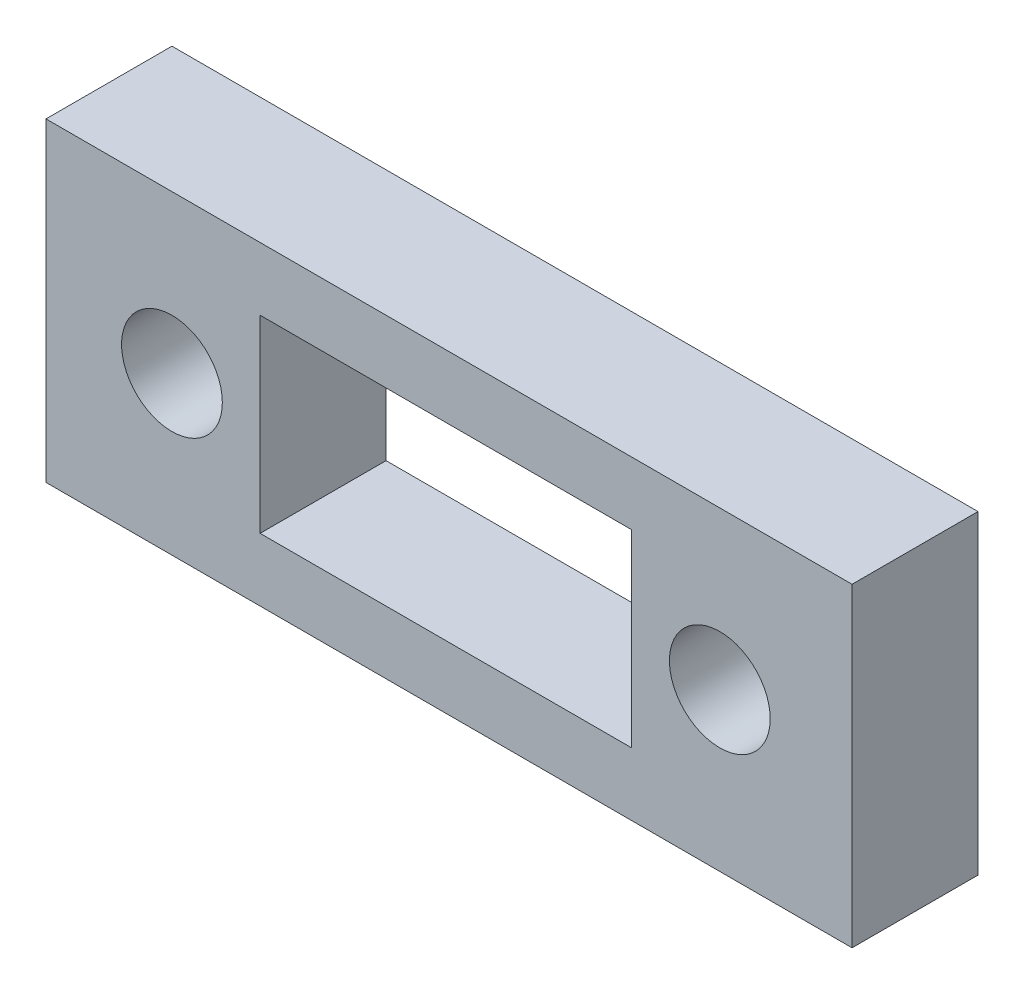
from build123d import *

# Parameters (mm, degrees)
ESQUISSE1_W             = 64
ESQUISSE1_H             = 25
BOSS_EXTRU_1_DEPTH      = 10
ESQUISSE2_R             = 4
ENL_V_MAT_EXTRU_3_DEPTH = 10
ESQUISSE4_W             = 29.5
ESQUISSE4_H             = 15
ENL_V_MAT_EXTRU_4_DEPTH = 10


with BuildPart() as part:
    # Esquisse1 → Boss.-Extru.1 (new body)
    with BuildSketch(Plane.XY):
        with Locations((24.950474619, -3.025803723)):
            Rectangle(ESQUISSE1_W, ESQUISSE1_H)
    extrude(amount=BOSS_EXTRU_1_DEPTH)

    # Esquisse2 → Enl_v. mat.-Extru.3 (cut)
    with BuildSketch(Plane.XY.offset(10)):
        with Locations((2.950474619, -3.025803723)):
            Circle(ESQUISSE2_R)
        with Locations((46.450474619, -3.025803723)):
            Circle(ESQUISSE2_R)
    extrude(amount=-ENL_V_MAT_EXTRU_3_DEPTH, mode=Mode.SUBTRACT)

    # Esquisse4 → Enl_v. mat.-Extru.4 (cut)
    with BuildSketch(Plane.XY.offset(10)):
        with Locations((24.700474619, -3.025803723)):
            Rectangle(ESQUISSE4_W, ESQUISSE4_H)
    extrude(amount=-ENL_V_MAT_EXTRU_4_DEPTH, mode=Mode.SUBTRACT)


solid = part.part
